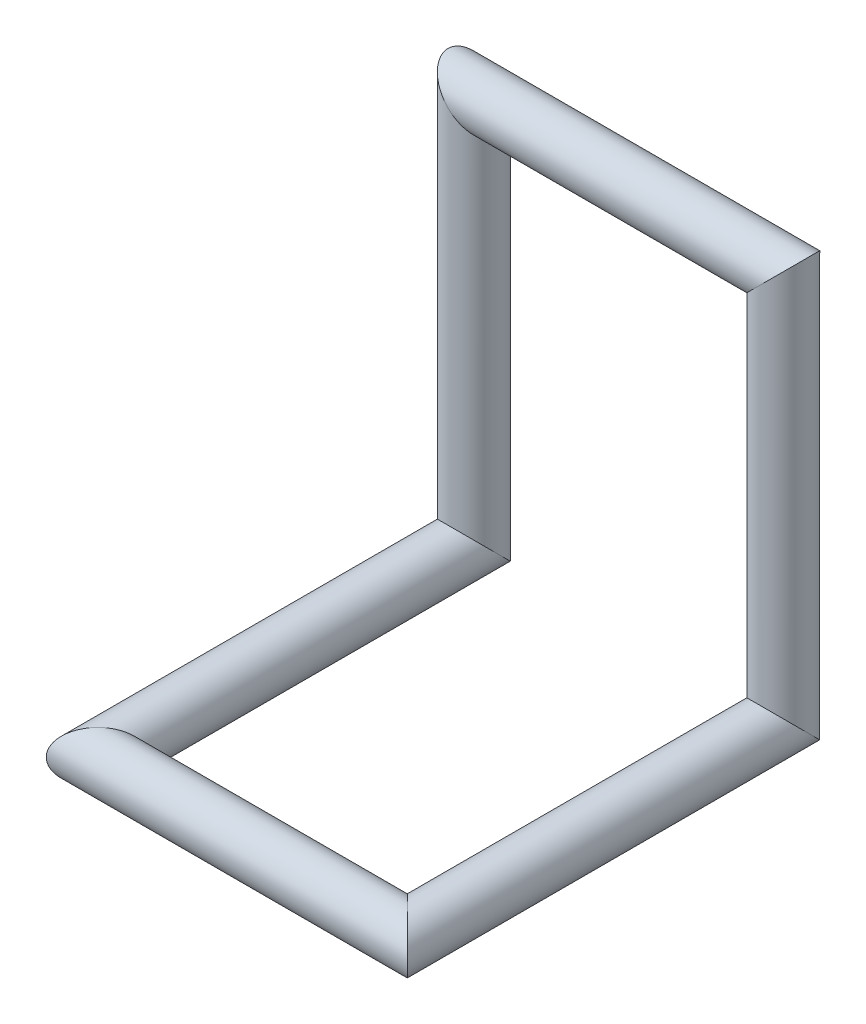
from build123d import *

# Parameters (mm, degrees)
SKETCH3_R = 6.35


with BuildPart() as part:
    # Sweep3: sweep along a curve in space
    with BuildLine() as sweep3_path:
        Line((76.2, 0, 92.569320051), (76.2, 0, 0))
        Line((76.2, 0, 0), (76.2, 95.330994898, 0))
        Line((76.2, 95.330994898, 0), (0, 95.330994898, 0))
        Line((0, 95.330994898, 0), (0, 0, 0))
        Line((0, 0, 0), (0, 0, 92.569320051))
        Line((0, 0, 92.569320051), (76.2, 0, 92.569320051))
    # Sketch3 → Sweep3 (sweep)
    with BuildSketch(Plane(origin=(0, 0, 0), x_dir=(1, 0, 0), z_dir=(0, 1, 0))):
        with Locations((76.2, 0)):
            Circle(SKETCH3_R)
    sweep(path=sweep3_path.line, transition=Transition.RIGHT)


solid = part.part
